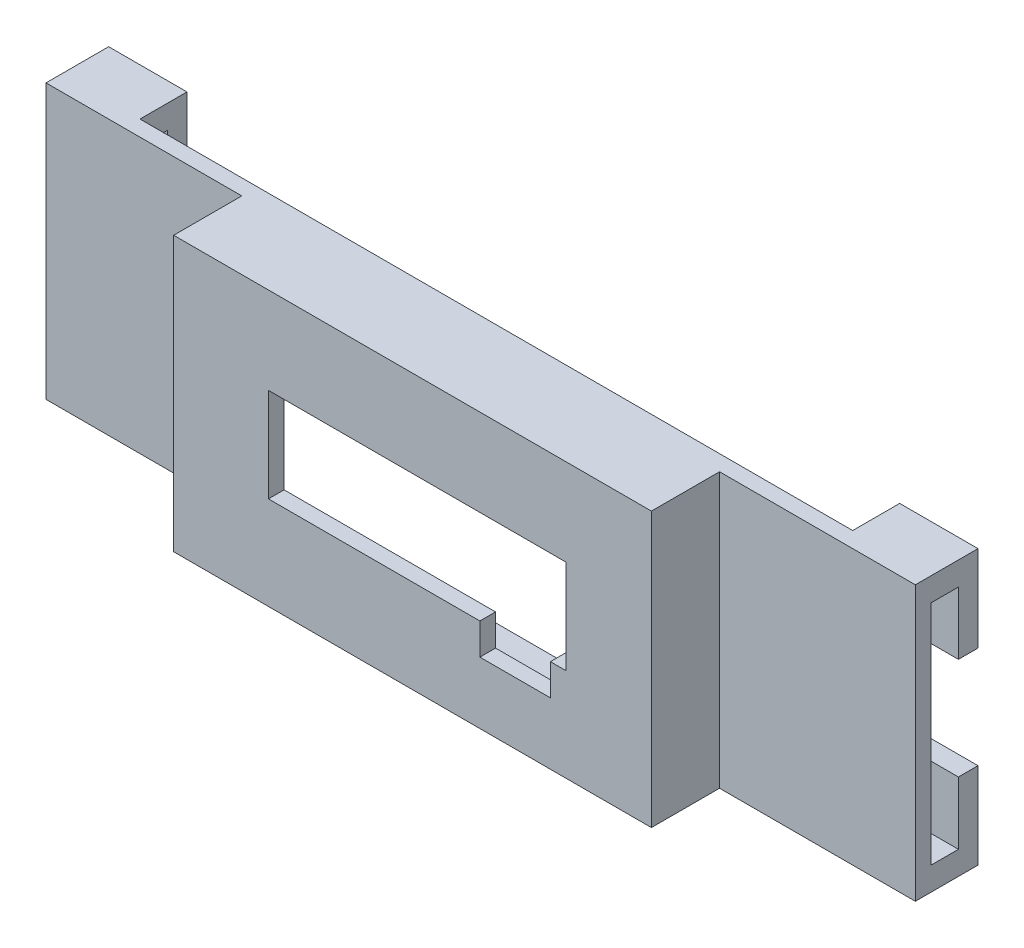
from build123d import *

# Parameters (mm, degrees)
CROQUIS1_W                = 61
CROQUIS1_H                = 35
SALIENTE_EXTRUIR1_DEPTH   = 2
CROQUIS2_W                = 61
CROQUIS2_H                = 35
CROQUIS2_W_2              = 57
CROQUIS2_H_2              = 31
SALIENTE_EXTRUIR2_DEPTH   = 8.7
CROQUIS3_W                = 2
CROQUIS3_H                = 35
SALIENTE_EXTRUIR3_DEPTH   = 25
CROQUIS7_W                = 10
CROQUIS7_H                = 3
SALIENTE_EXTRUIR7_DEPTH   = 6
CROQUIS8_W                = 10
CROQUIS8_H                = 2.5
SALIENTE_EXTRUIR8_DEPTH   = 8
SIMETR_A4_COPY_1_SKETCH_W = 10
SIMETR_A4_COPY_1_SKETCH_H = 3
SIMETR_A4_COPY_1_DEPTH    = 6
SIMETR_A4_COPY_2_SKETCH_W = 10
SIMETR_A4_COPY_2_SKETCH_H = 2.5
SIMETR_A4_COPY_2_DEPTH    = 8


with BuildPart() as part:
    # Croquis1 → Saliente-Extruir1 (new body)
    with BuildSketch(Plane.XY):
        Rectangle(CROQUIS1_W, CROQUIS1_H)
        Polygon((17.6, -5.6), (19.6, -5.6), (19.6, 6.4), (-18.4, 6.4), (-18.4, -5.6), (8.6, -5.6), (8.6, -9.6), (17.6, -9.6), align=None, mode=Mode.SUBTRACT)
    extrude(amount=SALIENTE_EXTRUIR1_DEPTH)

    # Croquis2 → Saliente-Extruir2 (add)
    with BuildSketch(Plane(origin=(0, 0, 0), x_dir=(-1, 0, 0), z_dir=(0, 0, -1))):
        Rectangle(CROQUIS2_W, CROQUIS2_H)
        Rectangle(CROQUIS2_W_2, CROQUIS2_H_2, mode=Mode.SUBTRACT)
    extrude(amount=SALIENTE_EXTRUIR2_DEPTH)

    # Croquis3 → Saliente-Extruir3 (add)
    with BuildSketch(Plane(origin=(30.5, 0, 0), x_dir=(0, 0, -1), z_dir=(1, 0, 0))):
        with Locations((7.7, 0)):
            Rectangle(CROQUIS3_W, CROQUIS3_H)
    saliente_extruir3 = extrude(amount=SALIENTE_EXTRUIR3_DEPTH)

    # Croquis7 → Saliente-Extruir7 (add)
    with BuildSketch(Plane(origin=(0, 0, -8.7), x_dir=(-1, 0, 0), z_dir=(0, 0, -1))):
        with Locations((-50.5, 16)):
            Rectangle(CROQUIS7_W, CROQUIS7_H)
    saliente_extruir7 = extrude(amount=SALIENTE_EXTRUIR7_DEPTH)

    # Croquis8 → Saliente-Extruir8 (add)
    with BuildSketch(Plane(origin=(0, 14.5, 0), x_dir=(-1, 0, 0), z_dir=(0, -1, 0))):
        with Locations((-50.5, 13.45)):
            Rectangle(CROQUIS8_W, CROQUIS8_H)
    saliente_extruir8 = extrude(amount=SALIENTE_EXTRUIR8_DEPTH)

    # Simetr_a3: Saliente-Extruir7, Saliente-Extruir8 across plane
    add(saliente_extruir7.mirror(Plane(origin=(0, 0, 0), x_dir=(0, 0, 1), z_dir=(0, -1, 0))))
    add(saliente_extruir8.mirror(Plane(origin=(0, 0, 0), x_dir=(0, 0, 1), z_dir=(0, -1, 0))))

    # Simetr_a4: Saliente-Extruir3, Saliente-Extruir7, Saliente-Extruir8 across plane
    add(saliente_extruir3.mirror(Plane(origin=(0, 0, 0), x_dir=(0, 0, 1), z_dir=(1, 0, 0))))
    add(saliente_extruir7.mirror(Plane(origin=(0, 0, 0), x_dir=(0, 0, 1), z_dir=(1, 0, 0))))
    add(saliente_extruir8.mirror(Plane(origin=(0, 0, 0), x_dir=(0, 0, 1), z_dir=(1, 0, 0))))

    # Simetr_a4 copy 1 sketch → Simetr_a4 copy 1 (add)
    with BuildSketch(Plane(origin=(0, 0, -8.7), x_dir=(1, 0, 0), z_dir=(0, 0, -1))):
        with Locations((-50.5, 16)):
            Rectangle(SIMETR_A4_COPY_1_SKETCH_W, SIMETR_A4_COPY_1_SKETCH_H)
    extrude(amount=SIMETR_A4_COPY_1_DEPTH)

    # Simetr_a4 copy 2 sketch → Simetr_a4 copy 2 (add)
    with BuildSketch(Plane(origin=(0, -14.5, 0), x_dir=(1, 0, 0), z_dir=(0, 1, 0))):
        with Locations((-50.5, 13.45)):
            Rectangle(SIMETR_A4_COPY_2_SKETCH_W, SIMETR_A4_COPY_2_SKETCH_H)
    extrude(amount=SIMETR_A4_COPY_2_DEPTH)


solid = part.part
